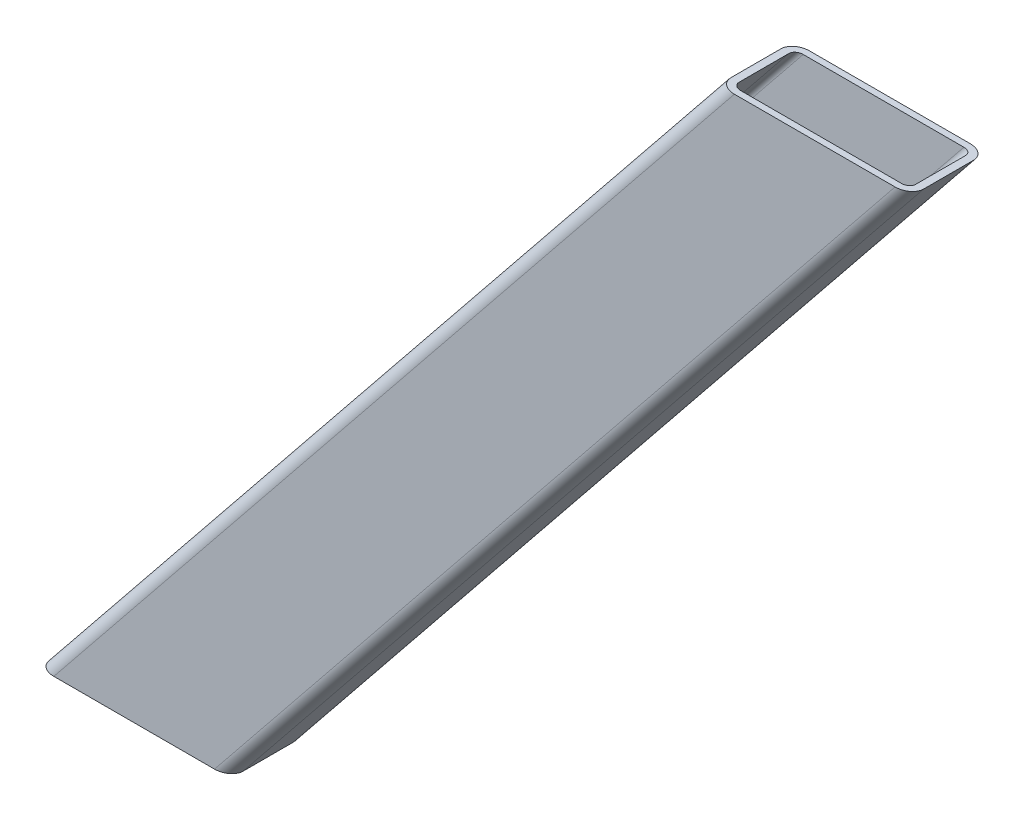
ISO-10303-21;
HEADER;
FILE_DESCRIPTION(('STEP AP214'),'2;1');
FILE_NAME('part.step','',(''),(''),'','','');
FILE_SCHEMA(('AUTOMOTIVE_DESIGN { 1 0 10303 214 1 1 1 1 }'));
ENDSEC;
DATA;
#1=APPLICATION_CONTEXT('core data for automotive mechanical design processes');
#2=APPLICATION_PROTOCOL_DEFINITION('international standard','automotive_design',2000,#1);
#3=PRODUCT_CONTEXT('',#1,'mechanical');
#4=PRODUCT('Part','Part','',(#3));
#5=PRODUCT_RELATED_PRODUCT_CATEGORY('part','',(#4));
#6=PRODUCT_DEFINITION_FORMATION('','',#4);
#7=PRODUCT_DEFINITION_CONTEXT('part definition',#1,'design');
#8=PRODUCT_DEFINITION('design','',#6,#7);
#9=PRODUCT_DEFINITION_SHAPE('','',#8);
#10=(LENGTH_UNIT() NAMED_UNIT(*) SI_UNIT(.MILLI.,.METRE.));
#11=(NAMED_UNIT(*) PLANE_ANGLE_UNIT() SI_UNIT($,.RADIAN.));
#12=(NAMED_UNIT(*) SI_UNIT($,.STERADIAN.) SOLID_ANGLE_UNIT());
#13=UNCERTAINTY_MEASURE_WITH_UNIT(LENGTH_MEASURE(1.E-05),#10,'distance_accuracy_value','');
#14=(GEOMETRIC_REPRESENTATION_CONTEXT(3) GLOBAL_UNCERTAINTY_ASSIGNED_CONTEXT((#13)) GLOBAL_UNIT_ASSIGNED_CONTEXT((#10,
#11,#12)) REPRESENTATION_CONTEXT('',''));
#15=CARTESIAN_POINT('',(0.,0.,0.));
#16=DIRECTION('',(0.,0.,1.));
#17=DIRECTION('',(1.,0.,0.));
#18=AXIS2_PLACEMENT_3D('',#15,#16,#17);
#19=CARTESIAN_POINT('',(443.638254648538,-382.621637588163,-330.2));
#20=DIRECTION('',(0.,-1.,0.));
#21=DIRECTION('',(0.,0.,-1.));
#22=AXIS2_PLACEMENT_3D('',#19,#20,#21);
#23=PLANE('',#22);
#24=CARTESIAN_POINT('',(-29.5026362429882,-382.621637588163,-127.));
#25=DIRECTION('',(0.,-1.,0.));
#26=DIRECTION('',(1.,0.,0.));
#27=AXIS2_PLACEMENT_3D('',#24,#25,#26);
#28=ELLIPSE('',#27,16.3109495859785,12.7);
#29=CARTESIAN_POINT('',(-45.8135858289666,-382.621637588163,-127.));
#30=VERTEX_POINT('',#29);
#31=CARTESIAN_POINT('',(-29.502636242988,-382.621637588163,-139.7));
#32=VERTEX_POINT('',#31);
#33=EDGE_CURVE('E165',#30,#32,#28,.T.);
#34=ORIENTED_EDGE('',*,*,#33,.T.);
#35=DIRECTION('',(1.,0.,0.));
#36=VECTOR('',#35,1.);
#37=CARTESIAN_POINT('',(-1226.3158580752,-382.621637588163,-139.700000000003));
#38=LINE('',#37,#36);
#39=CARTESIAN_POINT('',(296.716355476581,-382.621637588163,-139.699999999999));
#40=VERTEX_POINT('',#39);
#41=EDGE_CURVE('E162',#32,#40,#38,.T.);
#42=ORIENTED_EDGE('',*,*,#41,.T.);
#43=CARTESIAN_POINT('',(296.716355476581,-382.621637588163,-126.999999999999));
#44=DIRECTION('',(0.,-1.,0.));
#45=DIRECTION('',(1.,0.,0.));
#46=AXIS2_PLACEMENT_3D('',#43,#44,#45);
#47=ELLIPSE('',#46,16.3109495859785,12.7);
#48=CARTESIAN_POINT('',(313.02730506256,-382.621637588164,-126.999999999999));
#49=VERTEX_POINT('',#48);
#50=EDGE_CURVE('E159',#40,#49,#47,.T.);
#51=ORIENTED_EDGE('',*,*,#50,.T.);
#52=DIRECTION('',(0.,0.,1.));
#53=VECTOR('',#52,1.);
#54=CARTESIAN_POINT('',(313.02730506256,-382.621637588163,-126.999999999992));
#55=LINE('',#54,#53);
#56=CARTESIAN_POINT('',(313.02730506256,-382.621637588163,-25.399999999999));
#57=VERTEX_POINT('',#56);
#58=EDGE_CURVE('E156',#49,#57,#55,.T.);
#59=ORIENTED_EDGE('',*,*,#58,.T.);
#60=CARTESIAN_POINT('',(296.716355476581,-382.621637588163,-25.399999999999));
#61=DIRECTION('',(0.,-1.,0.));
#62=DIRECTION('',(1.,0.,0.));
#63=AXIS2_PLACEMENT_3D('',#60,#61,#62);
#64=ELLIPSE('',#63,16.3109495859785,12.7);
#65=CARTESIAN_POINT('',(296.716355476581,-382.621637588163,-12.699999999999));
#66=VERTEX_POINT('',#65);
#67=EDGE_CURVE('E153',#57,#66,#64,.T.);
#68=ORIENTED_EDGE('',*,*,#67,.T.);
#69=DIRECTION('',(-1.,0.,0.));
#70=VECTOR('',#69,1.);
#71=CARTESIAN_POINT('',(-1424.08484650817,-382.621637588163,-12.7000000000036));
#72=LINE('',#71,#70);
#73=CARTESIAN_POINT('',(-29.5026362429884,-382.621637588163,-12.6999999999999));
#74=VERTEX_POINT('',#73);
#75=EDGE_CURVE('E150',#66,#74,#72,.T.);
#76=ORIENTED_EDGE('',*,*,#75,.T.);
#77=CARTESIAN_POINT('',(-29.5026362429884,-382.621637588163,-25.3999999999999));
#78=DIRECTION('',(0.,-1.,0.));
#79=DIRECTION('',(1.,0.,0.));
#80=AXIS2_PLACEMENT_3D('',#77,#78,#79);
#81=ELLIPSE('',#80,16.3109495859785,12.7);
#82=CARTESIAN_POINT('',(-45.8135858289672,-382.621637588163,-25.4));
#83=VERTEX_POINT('',#82);
#84=EDGE_CURVE('E147',#74,#83,#81,.T.);
#85=ORIENTED_EDGE('',*,*,#84,.T.);
#86=DIRECTION('',(0.,0.,-1.));
#87=VECTOR('',#86,1.);
#88=CARTESIAN_POINT('',(-45.8135858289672,-382.621637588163,-25.3999999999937));
#89=LINE('',#88,#87);
#90=EDGE_CURVE('E143',#83,#30,#89,.T.);
#91=ORIENTED_EDGE('',*,*,#90,.T.);
#92=EDGE_LOOP('',(#34,#42,#51,#59,#68,#76,#85,#91));
#93=FACE_BOUND('',#92,.T.);
#94=DIRECTION('',(-1.,0.,0.));
#95=VECTOR('',#94,1.);
#96=CARTESIAN_POINT('',(-1424.08484650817,-382.621637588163,-3.61654066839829E-12));
#97=LINE('',#96,#95);
#98=CARTESIAN_POINT('',(296.716355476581,-382.621637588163,1.06858966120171E-12));
#99=VERTEX_POINT('',#98);
#100=CARTESIAN_POINT('',(-29.5026362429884,-382.621637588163,1.80411241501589E-13));
#101=VERTEX_POINT('',#100);
#102=EDGE_CURVE('E110',#99,#101,#97,.T.);
#103=ORIENTED_EDGE('',*,*,#102,.F.);
#104=CARTESIAN_POINT('',(296.716355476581,-382.621637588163,-25.399999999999));
#105=DIRECTION('',(0.,-1.,0.));
#106=DIRECTION('',(1.,0.,0.));
#107=AXIS2_PLACEMENT_3D('',#104,#105,#106);
#108=ELLIPSE('',#107,32.621899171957,25.4);
#109=CARTESIAN_POINT('',(329.338254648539,-382.621637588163,-25.3999999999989));
#110=VERTEX_POINT('',#109);
#111=EDGE_CURVE('E113',#110,#99,#108,.T.);
#112=ORIENTED_EDGE('',*,*,#111,.F.);
#113=DIRECTION('',(0.,0.,1.));
#114=VECTOR('',#113,1.);
#115=CARTESIAN_POINT('',(329.338254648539,-382.621637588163,-126.999999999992));
#116=LINE('',#115,#114);
#117=CARTESIAN_POINT('',(329.338254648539,-382.621637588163,-126.999999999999));
#118=VERTEX_POINT('',#117);
#119=EDGE_CURVE('E140',#118,#110,#116,.T.);
#120=ORIENTED_EDGE('',*,*,#119,.F.);
#121=CARTESIAN_POINT('',(296.716355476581,-382.621637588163,-126.999999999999));
#122=DIRECTION('',(0.,-1.,0.));
#123=DIRECTION('',(1.,0.,0.));
#124=AXIS2_PLACEMENT_3D('',#121,#122,#123);
#125=ELLIPSE('',#124,32.621899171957,25.4);
#126=CARTESIAN_POINT('',(296.716355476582,-382.621637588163,-152.399999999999));
#127=VERTEX_POINT('',#126);
#128=EDGE_CURVE('E179',#127,#118,#125,.T.);
#129=ORIENTED_EDGE('',*,*,#128,.F.);
#130=DIRECTION('',(1.,0.,0.));
#131=VECTOR('',#130,1.);
#132=CARTESIAN_POINT('',(-1226.3158580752,-382.621637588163,-152.400000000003));
#133=LINE('',#132,#131);
#134=CARTESIAN_POINT('',(-29.5026362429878,-382.621637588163,-152.4));
#135=VERTEX_POINT('',#134);
#136=EDGE_CURVE('E174',#135,#127,#133,.T.);
#137=ORIENTED_EDGE('',*,*,#136,.F.);
#138=CARTESIAN_POINT('',(-29.5026362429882,-382.621637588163,-127.));
#139=DIRECTION('',(0.,-1.,0.));
#140=DIRECTION('',(1.,0.,0.));
#141=AXIS2_PLACEMENT_3D('',#138,#139,#140);
#142=ELLIPSE('',#141,32.621899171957,25.4);
#143=CARTESIAN_POINT('',(-62.1245354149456,-382.621637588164,-127.));
#144=VERTEX_POINT('',#143);
#145=EDGE_CURVE('E239',#144,#135,#142,.T.);
#146=ORIENTED_EDGE('',*,*,#145,.F.);
#147=DIRECTION('',(0.,0.,-1.));
#148=VECTOR('',#147,1.);
#149=CARTESIAN_POINT('',(-62.124535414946,-382.621637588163,-25.3999999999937));
#150=LINE('',#149,#148);
#151=CARTESIAN_POINT('',(-62.1245354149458,-382.621637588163,-25.4));
#152=VERTEX_POINT('',#151);
#153=EDGE_CURVE('E71',#152,#144,#150,.T.);
#154=ORIENTED_EDGE('',*,*,#153,.F.);
#155=CARTESIAN_POINT('',(-29.5026362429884,-382.621637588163,-25.3999999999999));
#156=DIRECTION('',(0.,-1.,0.));
#157=DIRECTION('',(1.,0.,0.));
#158=AXIS2_PLACEMENT_3D('',#155,#156,#157);
#159=ELLIPSE('',#158,32.621899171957,25.4);
#160=EDGE_CURVE('E117',#101,#152,#159,.T.);
#161=ORIENTED_EDGE('',*,*,#160,.F.);
#162=EDGE_LOOP('',(#103,#112,#120,#129,#137,#146,#154,#161));
#163=FACE_BOUND('',#162,.T.);
#164=ADVANCED_FACE('F62',(#93,#163),#23,.F.);
#165=CARTESIAN_POINT('',(-1424.08484650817,-2113.06009021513,-127.));
#166=DIRECTION('',(0.627498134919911,0.778618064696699,0.));
#167=DIRECTION('',(-0.778618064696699,0.627498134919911,0.));
#168=AXIS2_PLACEMENT_3D('',#165,#166,#167);
#169=CYLINDRICAL_SURFACE('',#168,12.7);
#170=ORIENTED_EDGE('',*,*,#33,.F.);
#171=DIRECTION('',(0.627498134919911,0.778618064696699,0.));
#172=VECTOR('',#171,1.);
#173=CARTESIAN_POINT('',(-1433.97329592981,-2105.09086390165,-127.));
#174=LINE('',#173,#172);
#175=CARTESIAN_POINT('',(-1427.55079576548,-2097.12163758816,-127.));
#176=VERTEX_POINT('',#175);
#177=EDGE_CURVE('E187',#176,#30,#174,.T.);
#178=ORIENTED_EDGE('',*,*,#177,.F.);
#179=CARTESIAN_POINT('',(-1411.23984617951,-2097.12163758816,-127.));
#180=DIRECTION('',(0.,1.,0.));
#181=DIRECTION('',(1.,0.,0.));
#182=AXIS2_PLACEMENT_3D('',#179,#180,#181);
#183=ELLIPSE('',#182,16.3109495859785,12.7);
#184=CARTESIAN_POINT('',(-1411.2398461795,-2097.12163758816,-139.7));
#185=VERTEX_POINT('',#184);
#186=EDGE_CURVE('E207',#185,#176,#183,.T.);
#187=ORIENTED_EDGE('',*,*,#186,.F.);
#188=DIRECTION('',(0.627498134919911,0.778618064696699,0.));
#189=VECTOR('',#188,1.);
#190=CARTESIAN_POINT('',(-1424.08484650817,-2113.06009021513,-139.7));
#191=LINE('',#190,#189);
#192=EDGE_CURVE('E146',#185,#32,#191,.T.);
#193=ORIENTED_EDGE('',*,*,#192,.T.);
#194=EDGE_LOOP('',(#170,#178,#187,#193));
#195=FACE_BOUND('',#194,.T.);
#196=ADVANCED_FACE('F326',(#195),#169,.F.);
#197=CARTESIAN_POINT('',(-1433.97329592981,-2105.09086390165,-25.4));
#198=DIRECTION('',(0.778618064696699,-0.627498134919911,0.));
#199=DIRECTION('',(0.627498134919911,0.778618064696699,0.));
#200=AXIS2_PLACEMENT_3D('',#197,#198,#199);
#201=PLANE('',#200);
#202=ORIENTED_EDGE('',*,*,#90,.F.);
#203=DIRECTION('',(0.627498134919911,0.778618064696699,0.));
#204=VECTOR('',#203,1.);
#205=CARTESIAN_POINT('',(-1433.97329592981,-2105.09086390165,-25.4));
#206=LINE('',#205,#204);
#207=CARTESIAN_POINT('',(-1427.55079576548,-2097.12163758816,-25.4));
#208=VERTEX_POINT('',#207);
#209=EDGE_CURVE('E190',#208,#83,#206,.T.);
#210=ORIENTED_EDGE('',*,*,#209,.F.);
#211=DIRECTION('',(0.,0.,1.));
#212=VECTOR('',#211,1.);
#213=CARTESIAN_POINT('',(-1427.55079576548,-2097.12163758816,-25.3999999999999));
#214=LINE('',#213,#212);
#215=EDGE_CURVE('E218',#176,#208,#214,.T.);
#216=ORIENTED_EDGE('',*,*,#215,.F.);
#217=ORIENTED_EDGE('',*,*,#177,.T.);
#218=EDGE_LOOP('',(#202,#210,#216,#217));
#219=FACE_BOUND('',#218,.T.);
#220=ADVANCED_FACE('F322',(#219),#201,.T.);
#221=CARTESIAN_POINT('',(-1424.08484650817,-2113.06009021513,-25.3999999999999));
#222=DIRECTION('',(0.627498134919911,0.778618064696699,0.));
#223=DIRECTION('',(-0.778618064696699,0.627498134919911,0.));
#224=AXIS2_PLACEMENT_3D('',#221,#222,#223);
#225=CYLINDRICAL_SURFACE('',#224,12.7);
#226=ORIENTED_EDGE('',*,*,#84,.F.);
#227=DIRECTION('',(0.627498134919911,0.778618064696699,0.));
#228=VECTOR('',#227,1.);
#229=CARTESIAN_POINT('',(-1424.08484650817,-2113.06009021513,-12.6999999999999));
#230=LINE('',#229,#228);
#231=CARTESIAN_POINT('',(-1411.23984617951,-2097.12163758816,-12.6999999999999));
#232=VERTEX_POINT('',#231);
#233=EDGE_CURVE('E193',#232,#74,#230,.T.);
#234=ORIENTED_EDGE('',*,*,#233,.F.);
#235=CARTESIAN_POINT('',(-1411.23984617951,-2097.12163758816,-25.3999999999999));
#236=DIRECTION('',(0.,1.,0.));
#237=DIRECTION('',(1.,0.,0.));
#238=AXIS2_PLACEMENT_3D('',#235,#236,#237);
#239=ELLIPSE('',#238,16.3109495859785,12.7);
#240=EDGE_CURVE('E221',#208,#232,#239,.T.);
#241=ORIENTED_EDGE('',*,*,#240,.F.);
#242=ORIENTED_EDGE('',*,*,#209,.T.);
#243=EDGE_LOOP('',(#226,#234,#241,#242));
#244=FACE_BOUND('',#243,.T.);
#245=ADVANCED_FACE('F332',(#244),#225,.F.);
#246=CARTESIAN_POINT('',(-1424.08484650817,-2113.06009021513,-12.6999999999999));
#247=DIRECTION('',(0.,0.,-1.));
#248=DIRECTION('',(-1.,0.,0.));
#249=AXIS2_PLACEMENT_3D('',#246,#247,#248);
#250=PLANE('',#249);
#251=ORIENTED_EDGE('',*,*,#75,.F.);
#252=DIRECTION('',(0.627498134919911,0.778618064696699,0.));
#253=VECTOR('',#252,1.);
#254=CARTESIAN_POINT('',(-1226.3158580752,-2272.44461648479,-12.699999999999));
#255=LINE('',#254,#253);
#256=CARTESIAN_POINT('',(-1085.02085445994,-2097.12163758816,-12.699999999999));
#257=VERTEX_POINT('',#256);
#258=EDGE_CURVE('E196',#257,#66,#255,.T.);
#259=ORIENTED_EDGE('',*,*,#258,.F.);
#260=DIRECTION('',(1.,0.,0.));
#261=VECTOR('',#260,1.);
#262=CARTESIAN_POINT('',(-1424.08484650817,-2097.12163758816,-12.6999999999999));
#263=LINE('',#262,#261);
#264=EDGE_CURVE('E224',#232,#257,#263,.T.);
#265=ORIENTED_EDGE('',*,*,#264,.F.);
#266=ORIENTED_EDGE('',*,*,#233,.T.);
#267=EDGE_LOOP('',(#251,#259,#265,#266));
#268=FACE_BOUND('',#267,.T.);
#269=ADVANCED_FACE('F336',(#268),#250,.T.);
#270=CARTESIAN_POINT('',(-1226.3158580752,-2272.44461648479,-25.399999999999));
#271=DIRECTION('',(0.627498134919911,0.778618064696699,0.));
#272=DIRECTION('',(-0.778618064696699,0.627498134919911,0.));
#273=AXIS2_PLACEMENT_3D('',#270,#271,#272);
#274=CYLINDRICAL_SURFACE('',#273,12.7);
#275=ORIENTED_EDGE('',*,*,#67,.F.);
#276=DIRECTION('',(0.627498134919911,0.778618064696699,0.));
#277=VECTOR('',#276,1.);
#278=CARTESIAN_POINT('',(-1216.42740865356,-2280.41384279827,-25.399999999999));
#279=LINE('',#278,#277);
#280=CARTESIAN_POINT('',(-1068.70990487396,-2097.12163758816,-25.399999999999));
#281=VERTEX_POINT('',#280);
#282=EDGE_CURVE('E199',#281,#57,#279,.T.);
#283=ORIENTED_EDGE('',*,*,#282,.F.);
#284=CARTESIAN_POINT('',(-1085.02085445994,-2097.12163758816,-25.399999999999));
#285=DIRECTION('',(0.,1.,0.));
#286=DIRECTION('',(1.,0.,0.));
#287=AXIS2_PLACEMENT_3D('',#284,#285,#286);
#288=ELLIPSE('',#287,16.3109495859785,12.7);
#289=EDGE_CURVE('E227',#257,#281,#288,.T.);
#290=ORIENTED_EDGE('',*,*,#289,.F.);
#291=ORIENTED_EDGE('',*,*,#258,.T.);
#292=EDGE_LOOP('',(#275,#283,#290,#291));
#293=FACE_BOUND('',#292,.T.);
#294=ADVANCED_FACE('F343',(#293),#274,.F.);
#295=CARTESIAN_POINT('',(-1216.42740865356,-2280.41384279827,-126.999999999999));
#296=DIRECTION('',(-0.778618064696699,0.627498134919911,0.));
#297=DIRECTION('',(-0.627498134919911,-0.778618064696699,0.));
#298=AXIS2_PLACEMENT_3D('',#295,#296,#297);
#299=PLANE('',#298);
#300=ORIENTED_EDGE('',*,*,#58,.F.);
#301=DIRECTION('',(0.627498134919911,0.778618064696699,0.));
#302=VECTOR('',#301,1.);
#303=CARTESIAN_POINT('',(-1216.42740865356,-2280.41384279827,-126.999999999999));
#304=LINE('',#303,#302);
#305=CARTESIAN_POINT('',(-1068.70990487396,-2097.12163758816,-126.999999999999));
#306=VERTEX_POINT('',#305);
#307=EDGE_CURVE('E202',#306,#49,#304,.T.);
#308=ORIENTED_EDGE('',*,*,#307,.F.);
#309=DIRECTION('',(0.,0.,-1.));
#310=VECTOR('',#309,1.);
#311=CARTESIAN_POINT('',(-1068.70990487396,-2097.12163758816,-126.999999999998));
#312=LINE('',#311,#310);
#313=EDGE_CURVE('E230',#281,#306,#312,.T.);
#314=ORIENTED_EDGE('',*,*,#313,.F.);
#315=ORIENTED_EDGE('',*,*,#282,.T.);
#316=EDGE_LOOP('',(#300,#308,#314,#315));
#317=FACE_BOUND('',#316,.T.);
#318=ADVANCED_FACE('F345',(#317),#299,.T.);
#319=CARTESIAN_POINT('',(-1226.3158580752,-2272.44461648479,-126.999999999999));
#320=DIRECTION('',(0.627498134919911,0.778618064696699,0.));
#321=DIRECTION('',(-0.778618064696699,0.627498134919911,0.));
#322=AXIS2_PLACEMENT_3D('',#319,#320,#321);
#323=CYLINDRICAL_SURFACE('',#322,12.7);
#324=ORIENTED_EDGE('',*,*,#50,.F.);
#325=DIRECTION('',(0.627498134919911,0.778618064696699,0.));
#326=VECTOR('',#325,1.);
#327=CARTESIAN_POINT('',(-1226.3158580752,-2272.44461648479,-139.699999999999));
#328=LINE('',#327,#326);
#329=CARTESIAN_POINT('',(-1085.02085445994,-2097.12163758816,-139.699999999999));
#330=VERTEX_POINT('',#329);
#331=EDGE_CURVE('E205',#330,#40,#328,.T.);
#332=ORIENTED_EDGE('',*,*,#331,.F.);
#333=CARTESIAN_POINT('',(-1085.02085445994,-2097.12163758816,-126.999999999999));
#334=DIRECTION('',(0.,1.,0.));
#335=DIRECTION('',(1.,0.,0.));
#336=AXIS2_PLACEMENT_3D('',#333,#334,#335);
#337=ELLIPSE('',#336,16.3109495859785,12.7);
#338=EDGE_CURVE('E233',#306,#330,#337,.T.);
#339=ORIENTED_EDGE('',*,*,#338,.F.);
#340=ORIENTED_EDGE('',*,*,#307,.T.);
#341=EDGE_LOOP('',(#324,#332,#339,#340));
#342=FACE_BOUND('',#341,.T.);
#343=ADVANCED_FACE('F349',(#342),#323,.F.);
#344=CARTESIAN_POINT('',(-1226.3158580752,-2272.44461648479,-139.699999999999));
#345=DIRECTION('',(0.,0.,1.));
#346=DIRECTION('',(1.,0.,0.));
#347=AXIS2_PLACEMENT_3D('',#344,#345,#346);
#348=PLANE('',#347);
#349=ORIENTED_EDGE('',*,*,#41,.F.);
#350=ORIENTED_EDGE('',*,*,#192,.F.);
#351=DIRECTION('',(-1.,0.,0.));
#352=VECTOR('',#351,1.);
#353=CARTESIAN_POINT('',(-1226.3158580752,-2097.12163758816,-139.699999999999));
#354=LINE('',#353,#352);
#355=EDGE_CURVE('E170',#330,#185,#354,.T.);
#356=ORIENTED_EDGE('',*,*,#355,.F.);
#357=ORIENTED_EDGE('',*,*,#331,.T.);
#358=EDGE_LOOP('',(#349,#350,#356,#357));
#359=FACE_BOUND('',#358,.T.);
#360=ADVANCED_FACE('F353',(#359),#348,.T.);
#361=CARTESIAN_POINT('',(-943.861745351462,-2097.12163758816,-457.2));
#362=DIRECTION('',(0.,1.,0.));
#363=DIRECTION('',(0.,0.,1.));
#364=AXIS2_PLACEMENT_3D('',#361,#362,#363);
#365=PLANE('',#364);
#366=ORIENTED_EDGE('',*,*,#186,.T.);
#367=ORIENTED_EDGE('',*,*,#215,.T.);
#368=ORIENTED_EDGE('',*,*,#240,.T.);
#369=ORIENTED_EDGE('',*,*,#264,.T.);
#370=ORIENTED_EDGE('',*,*,#289,.T.);
#371=ORIENTED_EDGE('',*,*,#313,.T.);
#372=ORIENTED_EDGE('',*,*,#338,.T.);
#373=ORIENTED_EDGE('',*,*,#355,.T.);
#374=EDGE_LOOP('',(#366,#367,#368,#369,#370,#371,#372,#373));
#375=FACE_BOUND('',#374,.T.);
#376=DIRECTION('',(0.,0.,1.));
#377=VECTOR('',#376,1.);
#378=CARTESIAN_POINT('',(-1443.86174535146,-2097.12163758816,-25.4));
#379=LINE('',#378,#377);
#380=CARTESIAN_POINT('',(-1443.86174535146,-2097.12163758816,-127.));
#381=VERTEX_POINT('',#380);
#382=CARTESIAN_POINT('',(-1443.86174535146,-2097.12163758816,-25.4));
#383=VERTEX_POINT('',#382);
#384=EDGE_CURVE('E13',#381,#383,#379,.T.);
#385=ORIENTED_EDGE('',*,*,#384,.F.);
#386=CARTESIAN_POINT('',(-1411.23984617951,-2097.12163758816,-127.));
#387=DIRECTION('',(0.,1.,0.));
#388=DIRECTION('',(1.,0.,0.));
#389=AXIS2_PLACEMENT_3D('',#386,#387,#388);
#390=ELLIPSE('',#389,32.621899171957,25.4);
#391=CARTESIAN_POINT('',(-1411.2398461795,-2097.12163758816,-152.4));
#392=VERTEX_POINT('',#391);
#393=EDGE_CURVE('E175',#392,#381,#390,.T.);
#394=ORIENTED_EDGE('',*,*,#393,.F.);
#395=DIRECTION('',(-1.,0.,0.));
#396=VECTOR('',#395,1.);
#397=CARTESIAN_POINT('',(-1226.3158580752,-2097.12163758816,-152.399999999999));
#398=LINE('',#397,#396);
#399=CARTESIAN_POINT('',(-1085.02085445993,-2097.12163758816,-152.399999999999));
#400=VERTEX_POINT('',#399);
#401=EDGE_CURVE('E180',#400,#392,#398,.T.);
#402=ORIENTED_EDGE('',*,*,#401,.F.);
#403=CARTESIAN_POINT('',(-1085.02085445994,-2097.12163758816,-126.999999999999));
#404=DIRECTION('',(0.,1.,0.));
#405=DIRECTION('',(1.,0.,0.));
#406=AXIS2_PLACEMENT_3D('',#403,#404,#405);
#407=ELLIPSE('',#406,32.621899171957,25.4);
#408=CARTESIAN_POINT('',(-1052.39895528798,-2097.12163758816,-126.999999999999));
#409=VERTEX_POINT('',#408);
#410=EDGE_CURVE('E183',#409,#400,#407,.T.);
#411=ORIENTED_EDGE('',*,*,#410,.F.);
#412=DIRECTION('',(0.,0.,-1.));
#413=VECTOR('',#412,1.);
#414=CARTESIAN_POINT('',(-1052.39895528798,-2097.12163758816,-126.999999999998));
#415=LINE('',#414,#413);
#416=CARTESIAN_POINT('',(-1052.39895528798,-2097.12163758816,-25.3999999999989));
#417=VERTEX_POINT('',#416);
#418=EDGE_CURVE('E137',#417,#409,#415,.T.);
#419=ORIENTED_EDGE('',*,*,#418,.F.);
#420=CARTESIAN_POINT('',(-1085.02085445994,-2097.12163758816,-25.399999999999));
#421=DIRECTION('',(0.,1.,0.));
#422=DIRECTION('',(1.,0.,0.));
#423=AXIS2_PLACEMENT_3D('',#420,#421,#422);
#424=ELLIPSE('',#423,32.621899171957,25.4);
#425=CARTESIAN_POINT('',(-1085.02085445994,-2097.12163758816,1.06858966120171E-12));
#426=VERTEX_POINT('',#425);
#427=EDGE_CURVE('E129',#426,#417,#424,.T.);
#428=ORIENTED_EDGE('',*,*,#427,.F.);
#429=DIRECTION('',(1.,0.,0.));
#430=VECTOR('',#429,1.);
#431=CARTESIAN_POINT('',(-1424.08484650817,-2097.12163758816,1.45438869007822E-13));
#432=LINE('',#431,#430);
#433=CARTESIAN_POINT('',(-1411.23984617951,-2097.12163758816,1.80411241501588E-13));
#434=VERTEX_POINT('',#433);
#435=EDGE_CURVE('E121',#434,#426,#432,.T.);
#436=ORIENTED_EDGE('',*,*,#435,.F.);
#437=CARTESIAN_POINT('',(-1411.23984617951,-2097.12163758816,-25.3999999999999));
#438=DIRECTION('',(0.,1.,0.));
#439=DIRECTION('',(1.,0.,0.));
#440=AXIS2_PLACEMENT_3D('',#437,#438,#439);
#441=ELLIPSE('',#440,32.621899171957,25.4);
#442=EDGE_CURVE('E80',#383,#434,#441,.T.);
#443=ORIENTED_EDGE('',*,*,#442,.F.);
#444=EDGE_LOOP('',(#385,#394,#402,#411,#419,#428,#436,#443));
#445=FACE_BOUND('',#444,.T.);
#446=ADVANCED_FACE('F279',(#375,#445),#365,.F.);
#447=CARTESIAN_POINT('',(-1424.08484650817,-2113.06009021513,-25.3999999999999));
#448=DIRECTION('',(0.627498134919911,0.778618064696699,0.));
#449=DIRECTION('',(-0.778618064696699,0.627498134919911,0.));
#450=AXIS2_PLACEMENT_3D('',#447,#448,#449);
#451=CYLINDRICAL_SURFACE('',#450,25.4);
#452=DIRECTION('',(0.627498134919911,0.778618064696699,0.));
#453=VECTOR('',#452,1.);
#454=CARTESIAN_POINT('',(-1424.08484650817,-2113.06009021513,1.80411241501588E-13));
#455=LINE('',#454,#453);
#456=EDGE_CURVE('E168',#434,#101,#455,.T.);
#457=ORIENTED_EDGE('',*,*,#456,.T.);
#458=ORIENTED_EDGE('',*,*,#160,.T.);
#459=DIRECTION('',(0.627498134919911,0.778618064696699,0.));
#460=VECTOR('',#459,1.);
#461=CARTESIAN_POINT('',(-1443.86174535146,-2097.12163758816,-25.4));
#462=LINE('',#461,#460);
#463=EDGE_CURVE('E208',#383,#152,#462,.T.);
#464=ORIENTED_EDGE('',*,*,#463,.F.);
#465=ORIENTED_EDGE('',*,*,#442,.T.);
#466=EDGE_LOOP('',(#457,#458,#464,#465));
#467=FACE_BOUND('',#466,.T.);
#468=ADVANCED_FACE('F360',(#467),#451,.T.);
#469=CARTESIAN_POINT('',(-1424.08484650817,-2113.06009021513,-127.));
#470=DIRECTION('',(0.627498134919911,0.778618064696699,0.));
#471=DIRECTION('',(-0.778618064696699,0.627498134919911,0.));
#472=AXIS2_PLACEMENT_3D('',#469,#470,#471);
#473=CYLINDRICAL_SURFACE('',#472,25.4);
#474=DIRECTION('',(0.627498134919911,0.778618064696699,0.));
#475=VECTOR('',#474,1.);
#476=CARTESIAN_POINT('',(-1443.86174535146,-2097.12163758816,-127.));
#477=LINE('',#476,#475);
#478=EDGE_CURVE('E65',#381,#144,#477,.T.);
#479=ORIENTED_EDGE('',*,*,#478,.T.);
#480=ORIENTED_EDGE('',*,*,#145,.T.);
#481=DIRECTION('',(0.627498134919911,0.778618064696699,0.));
#482=VECTOR('',#481,1.);
#483=CARTESIAN_POINT('',(-1424.08484650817,-2113.06009021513,-152.4));
#484=LINE('',#483,#482);
#485=EDGE_CURVE('E171',#392,#135,#484,.T.);
#486=ORIENTED_EDGE('',*,*,#485,.F.);
#487=ORIENTED_EDGE('',*,*,#393,.T.);
#488=EDGE_LOOP('',(#479,#480,#486,#487));
#489=FACE_BOUND('',#488,.T.);
#490=ADVANCED_FACE('F269',(#489),#473,.T.);
#491=CARTESIAN_POINT('',(-1226.3158580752,-2272.44461648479,-152.399999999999));
#492=DIRECTION('',(0.,0.,1.));
#493=DIRECTION('',(1.,0.,0.));
#494=AXIS2_PLACEMENT_3D('',#491,#492,#493);
#495=PLANE('',#494);
#496=ORIENTED_EDGE('',*,*,#485,.T.);
#497=ORIENTED_EDGE('',*,*,#136,.T.);
#498=DIRECTION('',(0.627498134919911,0.778618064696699,0.));
#499=VECTOR('',#498,1.);
#500=CARTESIAN_POINT('',(-1226.3158580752,-2272.44461648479,-152.399999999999));
#501=LINE('',#500,#499);
#502=EDGE_CURVE('E176',#400,#127,#501,.T.);
#503=ORIENTED_EDGE('',*,*,#502,.F.);
#504=ORIENTED_EDGE('',*,*,#401,.T.);
#505=EDGE_LOOP('',(#496,#497,#503,#504));
#506=FACE_BOUND('',#505,.T.);
#507=ADVANCED_FACE('F262',(#506),#495,.F.);
#508=CARTESIAN_POINT('',(-1226.3158580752,-2272.44461648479,-126.999999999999));
#509=DIRECTION('',(0.627498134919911,0.778618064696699,0.));
#510=DIRECTION('',(-0.778618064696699,0.627498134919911,0.));
#511=AXIS2_PLACEMENT_3D('',#508,#509,#510);
#512=CYLINDRICAL_SURFACE('',#511,25.4);
#513=ORIENTED_EDGE('',*,*,#502,.T.);
#514=ORIENTED_EDGE('',*,*,#128,.T.);
#515=DIRECTION('',(0.627498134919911,0.778618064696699,0.));
#516=VECTOR('',#515,1.);
#517=CARTESIAN_POINT('',(-1206.53895923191,-2288.38306911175,-126.999999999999));
#518=LINE('',#517,#516);
#519=EDGE_CURVE('E181',#409,#118,#518,.T.);
#520=ORIENTED_EDGE('',*,*,#519,.F.);
#521=ORIENTED_EDGE('',*,*,#410,.T.);
#522=EDGE_LOOP('',(#513,#514,#520,#521));
#523=FACE_BOUND('',#522,.T.);
#524=ADVANCED_FACE('F259',(#523),#512,.T.);
#525=CARTESIAN_POINT('',(-1206.53895923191,-2288.38306911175,-126.999999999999));
#526=DIRECTION('',(-0.778618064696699,0.627498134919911,0.));
#527=DIRECTION('',(-0.627498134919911,-0.778618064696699,0.));
#528=AXIS2_PLACEMENT_3D('',#525,#526,#527);
#529=PLANE('',#528);
#530=ORIENTED_EDGE('',*,*,#519,.T.);
#531=ORIENTED_EDGE('',*,*,#119,.T.);
#532=DIRECTION('',(0.627498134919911,0.778618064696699,0.));
#533=VECTOR('',#532,1.);
#534=CARTESIAN_POINT('',(-1206.53895923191,-2288.38306911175,-25.3999999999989));
#535=LINE('',#534,#533);
#536=EDGE_CURVE('E133',#417,#110,#535,.T.);
#537=ORIENTED_EDGE('',*,*,#536,.F.);
#538=ORIENTED_EDGE('',*,*,#418,.T.);
#539=EDGE_LOOP('',(#530,#531,#537,#538));
#540=FACE_BOUND('',#539,.T.);
#541=ADVANCED_FACE('F256',(#540),#529,.F.);
#542=CARTESIAN_POINT('',(-1226.3158580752,-2272.44461648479,-25.399999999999));
#543=DIRECTION('',(0.627498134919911,0.778618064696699,0.));
#544=DIRECTION('',(-0.778618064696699,0.627498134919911,0.));
#545=AXIS2_PLACEMENT_3D('',#542,#543,#544);
#546=CYLINDRICAL_SURFACE('',#545,25.4);
#547=ORIENTED_EDGE('',*,*,#536,.T.);
#548=ORIENTED_EDGE('',*,*,#111,.T.);
#549=DIRECTION('',(0.627498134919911,0.778618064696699,0.));
#550=VECTOR('',#549,1.);
#551=CARTESIAN_POINT('',(-1226.3158580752,-2272.44461648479,1.06858966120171E-12));
#552=LINE('',#551,#550);
#553=EDGE_CURVE('E122',#426,#99,#552,.T.);
#554=ORIENTED_EDGE('',*,*,#553,.F.);
#555=ORIENTED_EDGE('',*,*,#427,.T.);
#556=EDGE_LOOP('',(#547,#548,#554,#555));
#557=FACE_BOUND('',#556,.T.);
#558=ADVANCED_FACE('F131',(#557),#546,.T.);
#559=CARTESIAN_POINT('',(-1424.08484650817,-2113.06009021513,1.80411241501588E-13));
#560=DIRECTION('',(0.,0.,-1.));
#561=DIRECTION('',(-1.,0.,0.));
#562=AXIS2_PLACEMENT_3D('',#559,#560,#561);
#563=PLANE('',#562);
#564=ORIENTED_EDGE('',*,*,#553,.T.);
#565=ORIENTED_EDGE('',*,*,#102,.T.);
#566=ORIENTED_EDGE('',*,*,#456,.F.);
#567=ORIENTED_EDGE('',*,*,#435,.T.);
#568=EDGE_LOOP('',(#564,#565,#566,#567));
#569=FACE_BOUND('',#568,.T.);
#570=ADVANCED_FACE('F126',(#569),#563,.F.);
#571=CARTESIAN_POINT('',(-1443.86174535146,-2097.12163758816,-25.4));
#572=DIRECTION('',(0.778618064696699,-0.627498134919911,0.));
#573=DIRECTION('',(0.627498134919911,0.778618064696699,0.));
#574=AXIS2_PLACEMENT_3D('',#571,#572,#573);
#575=PLANE('',#574);
#576=ORIENTED_EDGE('',*,*,#463,.T.);
#577=ORIENTED_EDGE('',*,*,#153,.T.);
#578=ORIENTED_EDGE('',*,*,#478,.F.);
#579=ORIENTED_EDGE('',*,*,#384,.T.);
#580=EDGE_LOOP('',(#576,#577,#578,#579));
#581=FACE_BOUND('',#580,.T.);
#582=ADVANCED_FACE('F272',(#581),#575,.F.);
#583=CLOSED_SHELL('',(#164,#196,#220,#245,#269,#294,#318,#343,#360,#446,#468,#490,#507,#524,
#541,#558,#570,#582));
#584=MANIFOLD_SOLID_BREP('B2',#583);
#585=ADVANCED_BREP_SHAPE_REPRESENTATION('',(#18,#584),#14);
#586=SHAPE_DEFINITION_REPRESENTATION(#9,#585);
ENDSEC;
END-ISO-10303-21;
